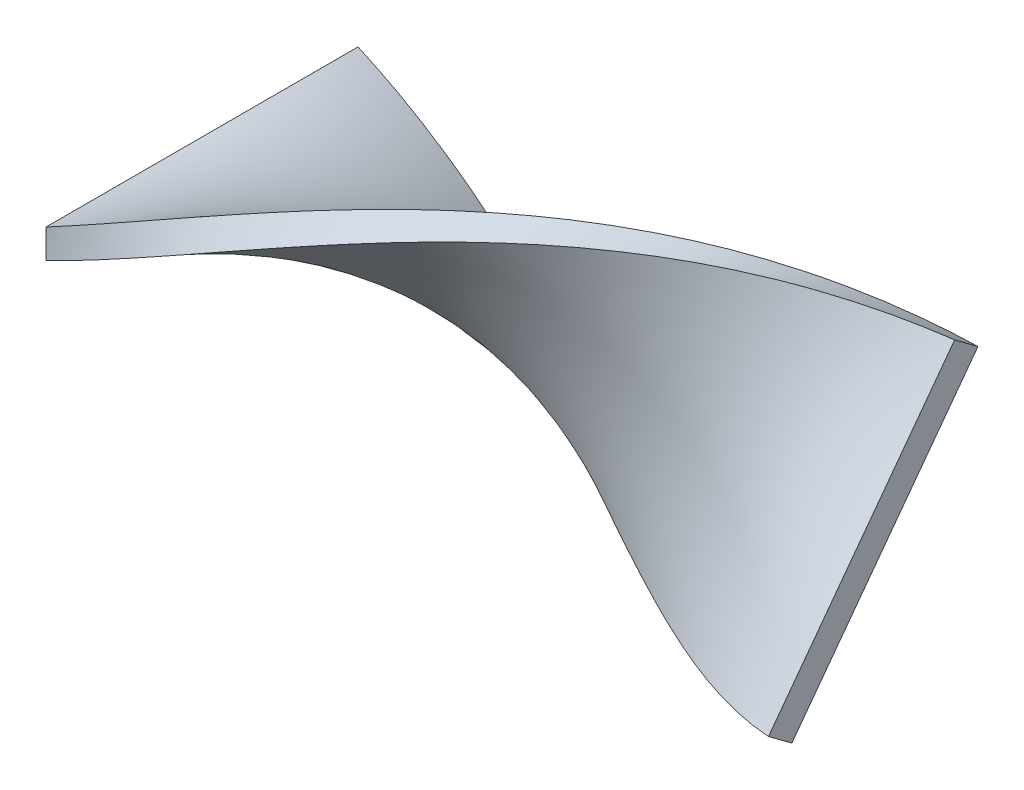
ISO-10303-21;
HEADER;
FILE_DESCRIPTION(('STEP AP214'),'2;1');
FILE_NAME('part.step','',(''),(''),'','','');
FILE_SCHEMA(('AUTOMOTIVE_DESIGN { 1 0 10303 214 1 1 1 1 }'));
ENDSEC;
DATA;
#1=APPLICATION_CONTEXT('core data for automotive mechanical design processes');
#2=APPLICATION_PROTOCOL_DEFINITION('international standard','automotive_design',2000,#1);
#3=PRODUCT_CONTEXT('',#1,'mechanical');
#4=PRODUCT('Part','Part','',(#3));
#5=PRODUCT_RELATED_PRODUCT_CATEGORY('part','',(#4));
#6=PRODUCT_DEFINITION_FORMATION('','',#4);
#7=PRODUCT_DEFINITION_CONTEXT('part definition',#1,'design');
#8=PRODUCT_DEFINITION('design','',#6,#7);
#9=PRODUCT_DEFINITION_SHAPE('','',#8);
#10=(LENGTH_UNIT() NAMED_UNIT(*) SI_UNIT(.MILLI.,.METRE.));
#11=(NAMED_UNIT(*) PLANE_ANGLE_UNIT() SI_UNIT($,.RADIAN.));
#12=(NAMED_UNIT(*) SI_UNIT($,.STERADIAN.) SOLID_ANGLE_UNIT());
#13=UNCERTAINTY_MEASURE_WITH_UNIT(LENGTH_MEASURE(1.E-05),#10,'distance_accuracy_value','');
#14=(GEOMETRIC_REPRESENTATION_CONTEXT(3) GLOBAL_UNCERTAINTY_ASSIGNED_CONTEXT((#13)) GLOBAL_UNIT_ASSIGNED_CONTEXT((#10,
#11,#12)) REPRESENTATION_CONTEXT('',''));
#15=CARTESIAN_POINT('',(0.,0.,0.));
#16=DIRECTION('',(0.,0.,1.));
#17=DIRECTION('',(1.,0.,0.));
#18=AXIS2_PLACEMENT_3D('',#15,#16,#17);
#19=CARTESIAN_POINT('',(-34.56399697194,0.,16.0727414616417));
#20=DIRECTION('',(1.,0.,0.));
#21=DIRECTION('',(0.,0.,-1.));
#22=AXIS2_PLACEMENT_3D('',#19,#20,#21);
#23=PLANE('',#22);
#24=DIRECTION('',(0.,0.,1.));
#25=VECTOR('',#24,1.);
#26=CARTESIAN_POINT('',(-34.5639969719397,0.,-9.19403442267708E-13));
#27=LINE('',#26,#25);
#28=CARTESIAN_POINT('',(-34.5639969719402,0.,-16.0727414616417));
#29=VERTEX_POINT('',#28);
#30=CARTESIAN_POINT('',(-34.5639969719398,0.,16.0727414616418));
#31=VERTEX_POINT('',#30);
#32=EDGE_CURVE('E13',#29,#31,#27,.T.);
#33=ORIENTED_EDGE('',*,*,#32,.T.);
#34=DIRECTION('',(0.,-1.,0.));
#35=VECTOR('',#34,1.);
#36=CARTESIAN_POINT('',(-34.5639969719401,1.5,16.0727414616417));
#37=LINE('',#36,#35);
#38=CARTESIAN_POINT('',(-34.5639969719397,2.99999999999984,16.0727414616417));
#39=VERTEX_POINT('',#38);
#40=EDGE_CURVE('E181',#39,#31,#37,.T.);
#41=ORIENTED_EDGE('',*,*,#40,.F.);
#42=DIRECTION('',(0.,0.,1.));
#43=VECTOR('',#42,1.);
#44=CARTESIAN_POINT('',(-34.5639969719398,2.99999999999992,-9.37618038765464E-13));
#45=LINE('',#44,#43);
#46=CARTESIAN_POINT('',(-34.5639969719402,3.00000000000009,-16.0727414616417));
#47=VERTEX_POINT('',#46);
#48=EDGE_CURVE('E217',#47,#39,#45,.T.);
#49=ORIENTED_EDGE('',*,*,#48,.F.);
#50=DIRECTION('',(0.,-1.,0.));
#51=VECTOR('',#50,1.);
#52=CARTESIAN_POINT('',(-34.5639969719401,1.5,-16.0727414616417));
#53=LINE('',#52,#51);
#54=EDGE_CURVE('E172',#47,#29,#53,.T.);
#55=ORIENTED_EDGE('',*,*,#54,.T.);
#56=EDGE_LOOP('',(#33,#41,#49,#55));
#57=FACE_BOUND('',#56,.T.);
#58=ADVANCED_FACE('F156',(#57),#23,.F.);
#59=CARTESIAN_POINT('',(34.56399697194,15.2753148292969,-8.37906919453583));
#60=CARTESIAN_POINT('',(34.56399697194,15.2693491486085,-8.38709481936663));
#61=CARTESIAN_POINT('',(34.56399697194,15.2633834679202,-8.39512044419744));
#62=CARTESIAN_POINT('',(34.56399697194,15.2574177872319,-8.40314606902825));
#63=CARTESIAN_POINT('',(34.5639969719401,14.6608497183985,-9.20570855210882));
#64=CARTESIAN_POINT('',(34.56399697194,14.0642816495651,-10.0082710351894));
#65=CARTESIAN_POINT('',(34.56399697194,13.4677135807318,-10.8108335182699));
#66=CARTESIAN_POINT('',(34.56399697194,13.4616882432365,-10.818939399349));
#67=CARTESIAN_POINT('',(34.56399697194,13.4556629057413,-10.8270452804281));
#68=CARTESIAN_POINT('',(34.56399697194,13.4496375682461,-10.8351511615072));
#69=CARTESIAN_POINT('',(29.0780211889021,16.7448598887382,-5.95901093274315));
#70=CARTESIAN_POINT('',(29.0780211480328,16.7403018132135,-5.96808282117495));
#71=CARTESIAN_POINT('',(29.0780211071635,16.7357437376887,-5.97715470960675));
#72=CARTESIAN_POINT('',(29.0780210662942,16.731185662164,-5.98622659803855));
#73=CARTESIAN_POINT('',(29.0780169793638,16.2753781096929,-6.89341544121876));
#74=CARTESIAN_POINT('',(29.0780170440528,15.819569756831,-7.80060634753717));
#75=CARTESIAN_POINT('',(29.0780212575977,15.3637596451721,-8.70779860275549));
#76=CARTESIAN_POINT('',(29.0780213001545,15.3591559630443,-8.7169612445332));
#77=CARTESIAN_POINT('',(29.0780213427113,15.3545522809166,-8.7261238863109));
#78=CARTESIAN_POINT('',(29.0780213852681,15.3499485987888,-8.73528652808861));
#79=CARTESIAN_POINT('',(19.2023691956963,18.2078331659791,-0.892584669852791));
#80=CARTESIAN_POINT('',(19.2023691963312,18.2063152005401,-0.902851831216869));
#81=CARTESIAN_POINT('',(19.2023691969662,18.2047972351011,-0.913118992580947));
#82=CARTESIAN_POINT('',(19.2023691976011,18.2032792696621,-0.923386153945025));
#83=CARTESIAN_POINT('',(19.2023692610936,18.0514827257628,-1.95010229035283));
#84=CARTESIAN_POINT('',(19.2023692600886,17.8996861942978,-2.97681839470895));
#85=CARTESIAN_POINT('',(19.2023691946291,17.7478896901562,-4.00353447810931));
#86=CARTESIAN_POINT('',(19.202369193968,17.7463565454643,-4.01390431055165));
#87=CARTESIAN_POINT('',(19.2023691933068,17.7448234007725,-4.02427414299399));
#88=CARTESIAN_POINT('',(19.2023691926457,17.7432902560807,-4.03464397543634));
#89=CARTESIAN_POINT('',(4.93771570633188,16.7798427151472,6.49494253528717));
#90=CARTESIAN_POINT('',(4.93771570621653,16.7829635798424,6.48512890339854));
#91=CARTESIAN_POINT('',(4.93771570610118,16.7860844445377,6.47531527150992));
#92=CARTESIAN_POINT('',(4.93771570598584,16.7892053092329,6.46550163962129));
#93=CARTESIAN_POINT('',(4.93771569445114,17.1012917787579,5.48413845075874));
#94=CARTESIAN_POINT('',(4.93771569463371,17.4133782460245,4.50277525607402));
#95=CARTESIAN_POINT('',(4.93771570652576,17.7254647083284,3.52141205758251));
#96=CARTESIAN_POINT('',(4.93771570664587,17.7286167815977,3.51150028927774));
#97=CARTESIAN_POINT('',(4.93771570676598,17.7317688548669,3.50158852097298));
#98=CARTESIAN_POINT('',(4.93771570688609,17.7349209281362,3.49167675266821));
#99=CARTESIAN_POINT('',(-7.13225567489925,13.1217089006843,11.7073304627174));
#100=CARTESIAN_POINT('',(-7.1322556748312,13.1282560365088,11.6994715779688));
#101=CARTESIAN_POINT('',(-7.13225567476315,13.1348031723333,11.6916126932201));
#102=CARTESIAN_POINT('',(-7.1322556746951,13.1413503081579,11.6837538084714));
#103=CARTESIAN_POINT('',(-7.13225566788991,13.7960638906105,10.8978653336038));
#104=CARTESIAN_POINT('',(-7.13225566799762,14.4507774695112,10.1119768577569));
#105=CARTESIAN_POINT('',(-7.13225567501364,15.1054910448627,9.32608838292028));
#106=CARTESIAN_POINT('',(-7.1322556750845,15.1121036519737,9.31815090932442));
#107=CARTESIAN_POINT('',(-7.13225567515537,15.1187162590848,9.31021343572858));
#108=CARTESIAN_POINT('',(-7.13225567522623,15.1253288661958,9.30227596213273));
#109=CARTESIAN_POINT('',(-20.2996387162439,7.40684570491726,15.5384666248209));
#110=CARTESIAN_POINT('',(-20.2996387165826,7.41608615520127,15.5339108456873));
#111=CARTESIAN_POINT('',(-20.2996387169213,7.42532660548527,15.5293550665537));
#112=CARTESIAN_POINT('',(-20.29963871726,7.43456705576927,15.5247992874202));
#113=CARTESIAN_POINT('',(-20.2996387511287,8.35861208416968,15.0692213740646));
#114=CARTESIAN_POINT('',(-20.2996387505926,9.28265713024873,14.6136434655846));
#115=CARTESIAN_POINT('',(-20.2996387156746,10.2067021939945,14.1580655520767));
#116=CARTESIAN_POINT('',(-20.2996387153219,10.2160350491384,14.1534642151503));
#117=CARTESIAN_POINT('',(-20.2996387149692,10.2253679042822,14.1488628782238));
#118=CARTESIAN_POINT('',(-20.2996387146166,10.234700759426,14.1442615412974));
#119=CARTESIAN_POINT('',(-29.0780211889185,2.78893162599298,16.3370692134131));
#120=CARTESIAN_POINT('',(-29.0780211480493,2.79893166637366,16.3353153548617));
#121=CARTESIAN_POINT('',(-29.0780211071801,2.80893170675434,16.3335614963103));
#122=CARTESIAN_POINT('',(-29.0780210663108,2.81893174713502,16.3318076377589));
#123=CARTESIAN_POINT('',(-29.0780169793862,3.81893578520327,16.1564217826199));
#124=CARTESIAN_POINT('',(-29.0780170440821,4.81893768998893,15.9810353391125));
#125=CARTESIAN_POINT('',(-29.0780212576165,5.81893746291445,15.8056495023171));
#126=CARTESIAN_POINT('',(-29.0780213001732,5.829037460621,15.8038781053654));
#127=CARTESIAN_POINT('',(-29.0780213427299,5.83913745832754,15.8021067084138));
#128=CARTESIAN_POINT('',(-29.0780213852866,5.84923745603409,15.8003353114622));
#129=CARTESIAN_POINT('',(-34.56399697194,-0.03,16.0727414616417));
#130=CARTESIAN_POINT('',(-34.56399697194,-0.02,16.0727414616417));
#131=CARTESIAN_POINT('',(-34.56399697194,-0.01,16.0727414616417));
#132=CARTESIAN_POINT('',(-34.56399697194,0.,16.0727414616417));
#133=CARTESIAN_POINT('',(-34.5639969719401,1.,16.0727414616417));
#134=CARTESIAN_POINT('',(-34.56399697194,2.,16.0727414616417));
#135=CARTESIAN_POINT('',(-34.56399697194,3.,16.0727414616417));
#136=CARTESIAN_POINT('',(-34.56399697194,3.0101,16.0727414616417));
#137=CARTESIAN_POINT('',(-34.56399697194,3.0202,16.0727414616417));
#138=CARTESIAN_POINT('',(-34.56399697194,3.0303,16.0727414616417));
#139=B_SPLINE_SURFACE_WITH_KNOTS('',3,3,((#59,#60,#61,#62,#63,#64,#65,#66,#67,#68),(#69,#70,#71,
#72,#73,#74,#75,#76,#77,#78),(#79,#80,#81,#82,#83,#84,#85,#86,#87,#88),(#89,#90,#91,#92,#93,#94,
#95,#96,#97,#98),(#99,#100,#101,#102,#103,#104,#105,#106,#107,#108),(#109,#110,#111,#112,#113,
#114,#115,#116,#117,#118),(#119,#120,#121,#122,#123,#124,#125,#126,#127,#128),(#129,#130,#131,
#132,#133,#134,#135,#136,#137,#138)),.UNSPECIFIED.,.F.,.F.,.F.,(4,1,1,1,1,4),(4,3,3,4),(0.,
0.238098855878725,0.428572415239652,0.619045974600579,0.761901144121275,1.),(-0.01,0.,1.,
1.0101),.UNSPECIFIED.);
#140=CARTESIAN_POINT('',(-34.56399697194,0.,16.0727414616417));
#141=CARTESIAN_POINT('',(-34.1025789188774,0.237097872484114,16.0945316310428));
#142=CARTESIAN_POINT('',(-33.641155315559,0.474672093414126,16.1109200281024));
#143=CARTESIAN_POINT('',(-32.718388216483,0.95025658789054,16.1329850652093));
#144=CARTESIAN_POINT('',(-32.2570447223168,1.18826676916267,16.1386637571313));
#145=CARTESIAN_POINT('',(-31.3337305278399,1.66461850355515,16.1394099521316));
#146=CARTESIAN_POINT('',(-30.8717598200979,1.90296007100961,16.1344631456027));
#147=CARTESIAN_POINT('',(-29.947742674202,2.37922611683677,16.1140250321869));
#148=CARTESIAN_POINT('',(-29.4856962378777,2.6171505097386,16.0985317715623));
#149=CARTESIAN_POINT('',(-27.7730295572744,3.49736253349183,16.0217346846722));
#150=CARTESIAN_POINT('',(-26.5222717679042,4.13681667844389,15.9273738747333));
#151=CARTESIAN_POINT('',(-24.0200799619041,5.40040031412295,15.6638865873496));
#152=CARTESIAN_POINT('',(-22.768645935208,6.02452157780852,15.4947208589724));
#153=CARTESIAN_POINT('',(-20.8916028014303,6.94237692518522,15.1861814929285));
#154=CARTESIAN_POINT('',(-20.2658802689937,7.24530220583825,15.0741899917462));
#155=CARTESIAN_POINT('',(-19.0144383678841,7.84389880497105,14.8321387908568));
#156=CARTESIAN_POINT('',(-18.38871899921,8.13957012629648,14.7020790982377));
#157=CARTESIAN_POINT('',(-17.1367135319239,8.72272294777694,14.4241046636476));
#158=CARTESIAN_POINT('',(-16.5104274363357,9.0101967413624,14.2761737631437));
#159=CARTESIAN_POINT('',(-15.257845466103,9.57569644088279,13.9632673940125));
#160=CARTESIAN_POINT('',(-14.6315495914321,9.85372231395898,13.7982918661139));
#161=CARTESIAN_POINT('',(-13.3790095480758,10.3993229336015,13.4519737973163));
#162=CARTESIAN_POINT('',(-12.7527653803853,10.6668987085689,13.2706328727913));
#163=CARTESIAN_POINT('',(-11.5002749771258,11.190681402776,12.8922152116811));
#164=CARTESIAN_POINT('',(-10.874028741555,11.4468883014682,12.6951384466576));
#165=CARTESIAN_POINT('',(-9.62155640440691,11.9469635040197,12.2859065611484));
#166=CARTESIAN_POINT('',(-8.99533030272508,12.1908321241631,12.0737518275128));
#167=CARTESIAN_POINT('',(-7.74287207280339,12.6652136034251,11.635048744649));
#168=CARTESIAN_POINT('',(-7.1166399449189,12.8957267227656,11.4085006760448));
#169=CARTESIAN_POINT('',(-6.02097277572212,13.2867281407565,11.000394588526));
#170=CARTESIAN_POINT('',(-5.55153863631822,13.4502980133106,10.8217748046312));
#171=CARTESIAN_POINT('',(-4.61267335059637,13.7692560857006,10.4574037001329));
#172=CARTESIAN_POINT('',(-4.14324220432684,13.924644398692,10.2716524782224));
#173=CARTESIAN_POINT('',(-2.73489542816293,14.3781456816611,9.70426692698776));
#174=CARTESIAN_POINT('',(-1.79593033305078,14.6635936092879,9.31250216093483));
#175=CARTESIAN_POINT('',(0.0819132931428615,15.1985218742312,8.50496313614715));
#176=CARTESIAN_POINT('',(1.02079182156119,15.4480013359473,8.08918829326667));
#177=CARTESIAN_POINT('',(2.89847856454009,15.9087010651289,7.23671087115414));
#178=CARTESIAN_POINT('',(3.83728677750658,16.1199206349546,6.80000791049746));
#179=CARTESIAN_POINT('',(5.71504661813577,16.5016354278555,5.909082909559));
#180=CARTESIAN_POINT('',(6.65399824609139,16.6721245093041,5.45485823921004));
#181=CARTESIAN_POINT('',(8.53197762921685,16.9714923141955,4.53305568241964));
#182=CARTESIAN_POINT('',(9.471005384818,17.1003707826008,4.06547771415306));
#183=CARTESIAN_POINT('',(11.349088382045,17.3158348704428,3.12090936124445));
#184=CARTESIAN_POINT('',(12.2881436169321,17.4024235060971,2.64391965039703));
#185=CARTESIAN_POINT('',(14.1661382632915,17.5326091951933,1.68423191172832));
#186=CARTESIAN_POINT('',(15.1050776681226,17.5762133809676,1.20153484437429));
#187=CARTESIAN_POINT('',(16.8153159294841,17.6157598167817,0.320387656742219));
#188=CARTESIAN_POINT('',(17.5866308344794,17.6188186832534,-0.0777254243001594));
#189=CARTESIAN_POINT('',(19.1291978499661,17.5950434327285,-0.873016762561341));
#190=CARTESIAN_POINT('',(19.9004499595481,17.5682121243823,-1.27019510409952));
#191=CARTESIAN_POINT('',(21.4429281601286,17.4853074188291,-2.06145969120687));
#192=CARTESIAN_POINT('',(22.2141542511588,17.4292349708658,-2.45554603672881));
#193=CARTESIAN_POINT('',(23.7565793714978,17.2883925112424,-3.23859806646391));
#194=CARTESIAN_POINT('',(24.5277784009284,17.2036226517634,-3.62756377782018));
#195=CARTESIAN_POINT('',(26.0710027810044,17.0058195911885,-4.39875439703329));
#196=CARTESIAN_POINT('',(26.8430281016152,16.8927552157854,-4.78097136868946));
#197=CARTESIAN_POINT('',(28.3870851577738,16.6389464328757,-5.53614232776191));
#198=CARTESIAN_POINT('',(29.1591168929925,16.4982013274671,-5.90909608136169));
#199=CARTESIAN_POINT('',(30.7032352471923,16.1895708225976,-6.64363344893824));
#200=CARTESIAN_POINT('',(31.4753218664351,16.0216836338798,-7.0052163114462));
#201=CARTESIAN_POINT('',(33.0196054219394,15.6593346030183,-7.71487141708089));
#202=CARTESIAN_POINT('',(33.7918023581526,15.4648689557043,-8.06294171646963));
#203=CARTESIAN_POINT('',(34.56399697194,15.2574177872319,-8.40314606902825));
#204=B_SPLINE_CURVE_WITH_KNOTS('',3,(#140,#141,#142,#143,#144,#145,#146,#147,#148,#149,#150,
#151,#152,#153,#154,#155,#156,#157,#158,#159,#160,#161,#162,#163,#164,#165,#166,#167,#168,#169,
#170,#171,#172,#173,#174,#175,#176,#177,#178,#179,#180,#181,#182,#183,#184,#185,#186,#187,#188,
#189,#190,#191,#192,#193,#194,#195,#196,#197,#198,#199,#200,#201,#202,#203),.UNSPECIFIED.,.F.,
.F.,(4,2,2,2,2,2,2,2,2,2,2,2,2,2,2,2,2,2,2,2,2,2,2,2,2,2,2,2,2,2,2,4),(0.,1.55764615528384,
3.11499385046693,4.67444017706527,6.23417547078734,10.45563605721,14.679314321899,
16.7915550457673,18.9037949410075,21.0179591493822,23.1321307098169,25.2460936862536,
27.3600604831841,29.4739730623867,31.5878444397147,33.1724288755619,34.7569913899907,
37.9261294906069,41.0953447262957,44.2646177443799,47.4343683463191,50.6041383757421,
53.7736822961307,56.9427002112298,59.5462174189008,62.1494900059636,64.7526780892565,
67.3558523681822,69.9619074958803,72.5680283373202,75.1743210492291,77.7809872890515),.UNSPECIFIED.);
#205=CARTESIAN_POINT('',(34.5639969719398,15.2574177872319,-8.40314606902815));
#206=VERTEX_POINT('',#205);
#207=EDGE_CURVE('E226',#31,#206,#204,.T.);
#208=DIRECTION('',(0.,0.596568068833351,0.802562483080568));
#209=VECTOR('',#208,1.);
#210=CARTESIAN_POINT('',(34.56399697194,14.3625656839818,-9.60698979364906));
#211=LINE('',#210,#209);
#212=CARTESIAN_POINT('',(34.5639969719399,13.4677135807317,-10.81083351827));
#213=VERTEX_POINT('',#212);
#214=EDGE_CURVE('E263',#213,#206,#211,.T.);
#215=CARTESIAN_POINT('',(-34.56399697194,3.,16.0727414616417));
#216=CARTESIAN_POINT('',(-33.6320295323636,3.47889871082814,16.0273726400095));
#217=CARTESIAN_POINT('',(-32.7000967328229,3.95562231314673,15.9599850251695));
#218=CARTESIAN_POINT('',(-30.8349676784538,4.90174310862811,15.7825149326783));
#219=CARTESIAN_POINT('',(-29.9017714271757,5.37112946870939,15.6723745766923));
#220=CARTESIAN_POINT('',(-27.7050579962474,6.46233131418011,15.3646019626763));
#221=CARTESIAN_POINT('',(-26.4415140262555,7.07930556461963,15.1498010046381));
#222=CARTESIAN_POINT('',(-23.9136227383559,8.28346752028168,14.6481612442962));
#223=CARTESIAN_POINT('',(-22.6492753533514,8.87063905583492,14.361283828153));
#224=CARTESIAN_POINT('',(-20.7528162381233,9.72233214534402,13.8796624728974));
#225=CARTESIAN_POINT('',(-20.1206122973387,10.0014114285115,13.7105522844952));
#226=CARTESIAN_POINT('',(-18.8562123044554,10.5488036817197,13.3556197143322));
#227=CARTESIAN_POINT('',(-18.2240162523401,10.8171166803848,13.1697973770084));
#228=CARTESIAN_POINT('',(-16.9590507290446,11.3421144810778,12.7818278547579));
#229=CARTESIAN_POINT('',(-16.3262812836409,11.5987879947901,12.5796653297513));
#230=CARTESIAN_POINT('',(-15.0607415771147,12.0993602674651,12.1600924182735));
#231=CARTESIAN_POINT('',(-14.4279713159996,12.3432589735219,11.9426819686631));
#232=CARTESIAN_POINT('',(-13.162486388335,12.8173772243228,11.493497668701));
#233=CARTESIAN_POINT('',(-12.5297717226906,13.0475981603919,11.2617252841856));
#234=CARTESIAN_POINT('',(-11.2643307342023,13.4935422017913,10.7846547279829));
#235=CARTESIAN_POINT('',(-10.6316044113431,13.7092652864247,10.5393565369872));
#236=CARTESIAN_POINT('',(-9.36617131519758,14.1253653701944,10.0360727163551));
#237=CARTESIAN_POINT('',(-8.73346454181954,14.3257427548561,9.77808740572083));
#238=CARTESIAN_POINT('',(-7.468061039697,14.7102914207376,9.25031125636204));
#239=CARTESIAN_POINT('',(-6.83536431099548,14.8944630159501,8.98052064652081));
#240=CARTESIAN_POINT('',(-5.72838659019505,15.2020515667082,8.49918593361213));
#241=CARTESIAN_POINT('',(-5.25410651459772,15.3291342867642,8.28997186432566));
#242=CARTESIAN_POINT('',(-4.30554405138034,15.573683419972,7.86603613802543));
#243=CARTESIAN_POINT('',(-3.83126166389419,15.6911499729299,7.65131456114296));
#244=CARTESIAN_POINT('',(-2.40833579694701,16.0288281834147,6.99956246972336));
#245=CARTESIAN_POINT('',(-1.45961881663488,16.2343169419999,6.55494686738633));
#246=CARTESIAN_POINT('',(0.437787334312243,16.6044828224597,5.64899132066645));
#247=CARTESIAN_POINT('',(1.38647650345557,16.7691588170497,5.18765091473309));
#248=CARTESIAN_POINT('',(3.28376401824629,17.0560221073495,4.25165958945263));
#249=CARTESIAN_POINT('',(4.23236236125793,17.1782084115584,3.77700835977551));
#250=CARTESIAN_POINT('',(6.12955541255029,17.3783478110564,2.81824562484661));
#251=CARTESIAN_POINT('',(7.07815011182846,17.4562966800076,2.33413322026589));
#252=CARTESIAN_POINT('',(8.97537034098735,17.5679096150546,1.36089351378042));
#253=CARTESIAN_POINT('',(9.92399587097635,17.6015735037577,0.871766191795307));
#254=CARTESIAN_POINT('',(11.8212497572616,17.6246107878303,-0.107299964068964));
#255=CARTESIAN_POINT('',(12.769878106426,17.6139879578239,-0.597238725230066));
#256=CARTESIAN_POINT('',(14.6670597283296,17.5484906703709,-1.57396332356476));
#257=CARTESIAN_POINT('',(15.6156129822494,17.4936244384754,-2.06074972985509));
#258=CARTESIAN_POINT('',(16.9389627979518,17.3862022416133,-2.73502085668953));
#259=CARTESIAN_POINT('',(17.3138319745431,17.3523148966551,-2.92547979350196));
#260=CARTESIAN_POINT('',(18.0635642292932,17.2776124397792,-3.30504409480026));
#261=CARTESIAN_POINT('',(18.4384273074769,17.2367973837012,-3.49414947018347));
#262=CARTESIAN_POINT('',(19.5629329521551,17.1040792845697,-4.05901553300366));
#263=CARTESIAN_POINT('',(20.3125921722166,17.0018951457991,-4.43237737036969));
#264=CARTESIAN_POINT('',(21.8118867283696,16.7710437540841,-5.17074259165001));
#265=CARTESIAN_POINT('',(22.5615220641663,16.6423775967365,-5.5357463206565));
#266=CARTESIAN_POINT('',(24.0607833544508,16.3594221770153,-6.25568575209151));
#267=CARTESIAN_POINT('',(24.810409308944,16.2051332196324,-6.61062157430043));
#268=CARTESIAN_POINT('',(26.3103113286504,15.8716312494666,-7.30899663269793));
#269=CARTESIAN_POINT('',(27.0605873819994,15.6923962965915,-7.6524254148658));
#270=CARTESIAN_POINT('',(28.5611510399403,15.3099430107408,-8.32568998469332));
#271=CARTESIAN_POINT('',(29.3114386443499,15.1067240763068,-8.65552543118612));
#272=CARTESIAN_POINT('',(30.8120614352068,14.6771380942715,-9.29980883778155));
#273=CARTESIAN_POINT('',(31.5623966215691,14.4507695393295,-9.61425579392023));
#274=CARTESIAN_POINT('',(33.0631580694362,13.9757388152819,-10.2259335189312));
#275=CARTESIAN_POINT('',(33.8135843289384,13.7270735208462,-10.5231618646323));
#276=CARTESIAN_POINT('',(34.56399697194,13.4677135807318,-10.8108335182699));
#277=B_SPLINE_CURVE_WITH_KNOTS('',3,(#215,#216,#217,#218,#219,#220,#221,#222,#223,#224,#225,
#226,#227,#228,#229,#230,#231,#232,#233,#234,#235,#236,#237,#238,#239,#240,#241,#242,#243,#244,
#245,#246,#247,#248,#249,#250,#251,#252,#253,#254,#255,#256,#257,#258,#259,#260,#261,#262,#263,
#264,#265,#266,#267,#268,#269,#270,#271,#272,#273,#274,#275,#276),.UNSPECIFIED.,.F.,.F.,(4,2,2,
2,2,2,2,2,2,2,2,2,2,2,2,2,2,2,2,2,2,2,2,2,2,2,2,2,2,2,4),(0.,3.14602391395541,6.29632182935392,
10.5614665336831,14.828901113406,16.9630318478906,19.0971569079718,21.2333092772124,
23.369470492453,25.505414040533,27.6413606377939,29.777253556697,31.9131050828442,
33.5141659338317,35.1152035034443,38.3172962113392,41.5194773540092,44.7217332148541,
47.9242949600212,51.1268695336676,54.3291711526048,57.5308775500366,58.7963552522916,
60.0618227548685,62.5924193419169,65.1229112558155,67.6533730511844,70.1860746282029,
72.7188397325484,75.2517698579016,77.7850555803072),.UNSPECIFIED.);
#278=EDGE_CURVE('E221',#39,#213,#277,.T.);
#279=ORIENTED_EDGE('',*,*,#207,.T.);
#280=ORIENTED_EDGE('',*,*,#214,.F.);
#281=ORIENTED_EDGE('',*,*,#278,.F.);
#282=ORIENTED_EDGE('',*,*,#40,.T.);
#283=EDGE_LOOP('',(#279,#280,#281,#282));
#284=FACE_BOUND('',#283,.T.);
#285=ADVANCED_FACE('F238',(#284),#139,.F.);
#286=CARTESIAN_POINT('',(34.56399697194,-10.541340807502,10.773822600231));
#287=DIRECTION('',(-1.,0.,0.));
#288=DIRECTION('',(0.,0.802562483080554,-0.59656806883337));
#289=AXIS2_PLACEMENT_3D('',#286,#287,#288);
#290=PLANE('',#289);
#291=DIRECTION('',(0.,-0.802562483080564,0.596568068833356));
#292=VECTOR('',#291,1.);
#293=CARTESIAN_POINT('',(34.5639969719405,2.35803848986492,1.18533826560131));
#294=LINE('',#293,#292);
#295=CARTESIAN_POINT('',(34.5639969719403,-10.5413408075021,10.7738226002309));
#296=VERTEX_POINT('',#295);
#297=EDGE_CURVE('E215',#206,#296,#294,.T.);
#298=ORIENTED_EDGE('',*,*,#297,.T.);
#299=DIRECTION('',(0.,0.596568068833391,0.802562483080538));
#300=VECTOR('',#299,1.);
#301=CARTESIAN_POINT('',(34.56399697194,-11.4361929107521,9.56997887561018));
#302=LINE('',#301,#300);
#303=CARTESIAN_POINT('',(34.5639969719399,-12.3310450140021,8.36613515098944));
#304=VERTEX_POINT('',#303);
#305=EDGE_CURVE('E203',#304,#296,#302,.T.);
#306=ORIENTED_EDGE('',*,*,#305,.F.);
#307=DIRECTION('',(0.,-0.802562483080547,0.596568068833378));
#308=VECTOR('',#307,1.);
#309=CARTESIAN_POINT('',(34.5639969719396,0.568334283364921,-1.22234918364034));
#310=LINE('',#309,#308);
#311=EDGE_CURVE('E210',#213,#304,#310,.T.);
#312=ORIENTED_EDGE('',*,*,#311,.F.);
#313=ORIENTED_EDGE('',*,*,#214,.T.);
#314=EDGE_LOOP('',(#298,#306,#312,#313));
#315=FACE_BOUND('',#314,.T.);
#316=ADVANCED_FACE('F158',(#315),#290,.F.);
#317=CARTESIAN_POINT('',(-34.56399697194,-0.03,-16.0727414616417));
#318=CARTESIAN_POINT('',(-34.56399697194,-0.02,-16.0727414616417));
#319=CARTESIAN_POINT('',(-34.56399697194,-0.00999999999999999,-16.0727414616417));
#320=CARTESIAN_POINT('',(-34.56399697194,0.,-16.0727414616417));
#321=CARTESIAN_POINT('',(-34.56399697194,0.999999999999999,-16.0727414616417));
#322=CARTESIAN_POINT('',(-34.56399697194,2.,-16.0727414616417));
#323=CARTESIAN_POINT('',(-34.56399697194,3.,-16.0727414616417));
#324=CARTESIAN_POINT('',(-34.56399697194,3.0101,-16.0727414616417));
#325=CARTESIAN_POINT('',(-34.56399697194,3.0202,-16.0727414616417));
#326=CARTESIAN_POINT('',(-34.56399697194,3.0303,-16.0727414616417));
#327=CARTESIAN_POINT('',(-29.0780211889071,-2.84893162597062,-15.8084137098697));
#328=CARTESIAN_POINT('',(-29.0780211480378,-2.83893166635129,-15.8101675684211));
#329=CARTESIAN_POINT('',(-29.0780211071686,-2.82893170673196,-15.8119214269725));
#330=CARTESIAN_POINT('',(-29.0780210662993,-2.81893174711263,-15.8136752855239));
#331=CARTESIAN_POINT('',(-29.078016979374,-1.81893578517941,-15.9890611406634));
#332=CARTESIAN_POINT('',(-29.0780170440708,-0.8189376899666,-16.164447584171));
#333=CARTESIAN_POINT('',(-29.0780212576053,0.181062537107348,-16.3398334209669));
#334=CARTESIAN_POINT('',(-29.078021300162,0.191162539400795,-16.3416048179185));
#335=CARTESIAN_POINT('',(-29.0780213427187,0.201262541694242,-16.3433762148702));
#336=CARTESIAN_POINT('',(-29.0780213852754,0.211362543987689,-16.3451476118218));
#337=CARTESIAN_POINT('',(-19.2023691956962,-7.78781841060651,-13.9600730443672));
#338=CARTESIAN_POINT('',(-19.2023691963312,-7.77867280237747,-13.9649798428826));
#339=CARTESIAN_POINT('',(-19.2023691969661,-7.76952719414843,-13.969886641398));
#340=CARTESIAN_POINT('',(-19.202369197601,-7.76038158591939,-13.9747934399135));
#341=CARTESIAN_POINT('',(-19.2023692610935,-6.84582076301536,-14.4654732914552));
#342=CARTESIAN_POINT('',(-19.2023692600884,-5.93125997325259,-14.9561531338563));
#343=CARTESIAN_POINT('',(-19.202369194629,-5.01669921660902,-15.4468329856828));
#344=CARTESIAN_POINT('',(-19.2023691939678,-5.00746215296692,-15.4517888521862));
#345=CARTESIAN_POINT('',(-19.2023691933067,-4.99822508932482,-15.4567447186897));
#346=CARTESIAN_POINT('',(-19.2023691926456,-4.98898802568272,-15.4617005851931));
#347=CARTESIAN_POINT('',(-4.93771570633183,-12.8648770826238,-8.40685864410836));
#348=CARTESIAN_POINT('',(-4.93771570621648,-12.8588628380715,-8.41521783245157));
#349=CARTESIAN_POINT('',(-4.93771570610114,-12.8528485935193,-8.42357702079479));
#350=CARTESIAN_POINT('',(-4.93771570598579,-12.8468343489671,-8.43193620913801));
#351=CARTESIAN_POINT('',(-4.93771569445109,-12.2454098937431,-9.26785504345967));
#352=CARTESIAN_POINT('',(-4.93771569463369,-11.6439854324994,-10.1037738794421));
#353=CARTESIAN_POINT('',(-4.93771570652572,-11.0425609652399,-10.939692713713));
#354=CARTESIAN_POINT('',(-4.93771570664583,-11.0364865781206,-10.9481354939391));
#355=CARTESIAN_POINT('',(-4.93771570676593,-11.0304121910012,-10.9565782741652));
#356=CARTESIAN_POINT('',(-4.93771570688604,-11.0243378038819,-10.9650210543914));
#357=CARTESIAN_POINT('',(7.13225567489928,-14.8658182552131,-2.3614334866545));
#358=CARTESIAN_POINT('',(7.13225567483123,-14.8634168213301,-2.37137633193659));
#359=CARTESIAN_POINT('',(7.13225567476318,-14.8610153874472,-2.38131917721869));
#360=CARTESIAN_POINT('',(7.13225567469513,-14.8586139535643,-2.39126202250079));
#361=CARTESIAN_POINT('',(7.13225566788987,-14.6184705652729,-3.38554655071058));
#362=CARTESIAN_POINT('',(7.13225566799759,-14.3783271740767,-4.37983107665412));
#363=CARTESIAN_POINT('',(7.13225567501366,-14.1381837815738,-5.37411559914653));
#364=CARTESIAN_POINT('',(7.13225567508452,-14.1357583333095,-5.3841578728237));
#365=CARTESIAN_POINT('',(7.13225567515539,-14.1333328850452,-5.39420014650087));
#366=CARTESIAN_POINT('',(7.13225567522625,-14.1309074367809,-5.40424242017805));
#367=CARTESIAN_POINT('',(20.2996387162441,-14.531239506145,4.51063481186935));
#368=CARTESIAN_POINT('',(20.2996387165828,-14.5330957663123,4.5005009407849));
#369=CARTESIAN_POINT('',(20.2996387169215,-14.5349520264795,4.49036706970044));
#370=CARTESIAN_POINT('',(20.2996387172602,-14.5368082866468,4.48023319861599));
#371=CARTESIAN_POINT('',(20.2996387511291,-14.7224343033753,3.46684609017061));
#372=CARTESIAN_POINT('',(20.299638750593,-14.9080603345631,2.45345897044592));
#373=CARTESIAN_POINT('',(20.2996387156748,-15.0936863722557,1.44007183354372));
#374=CARTESIAN_POINT('',(20.2996387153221,-15.0955611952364,1.42983662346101));
#375=CARTESIAN_POINT('',(20.2996387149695,-15.0974360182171,1.41960141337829));
#376=CARTESIAN_POINT('',(20.2996387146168,-15.0993108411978,1.40936620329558));
#377=CARTESIAN_POINT('',(29.0780211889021,-12.4172678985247,8.69322020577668));
#378=CARTESIAN_POINT('',(29.0780211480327,-12.4218260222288,8.68414825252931));
#379=CARTESIAN_POINT('',(29.0780211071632,-12.426384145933,8.67507629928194));
#380=CARTESIAN_POINT('',(29.0780210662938,-12.4309422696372,8.66600434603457));
#381=CARTESIAN_POINT('',(29.0780169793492,-12.8867546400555,7.75880902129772));
#382=CARTESIAN_POINT('',(29.0780170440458,-13.3425652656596,6.8516150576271));
#383=CARTESIAN_POINT('',(29.0780212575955,-13.7983751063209,5.94442316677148));
#384=CARTESIAN_POINT('',(29.0780213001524,-13.8029787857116,5.93526052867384));
#385=CARTESIAN_POINT('',(29.0780213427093,-13.8075824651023,5.9260978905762));
#386=CARTESIAN_POINT('',(29.0780213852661,-13.8121861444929,5.91693525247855));
#387=CARTESIAN_POINT('',(34.56399697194,-10.523443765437,10.7978994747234));
#388=CARTESIAN_POINT('',(34.56399697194,-10.5294094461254,10.7898738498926));
#389=CARTESIAN_POINT('',(34.56399697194,-10.5353751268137,10.7818482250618));
#390=CARTESIAN_POINT('',(34.56399697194,-10.541340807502,10.773822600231));
#391=CARTESIAN_POINT('',(34.56399697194,-11.1379088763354,9.97126011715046));
#392=CARTESIAN_POINT('',(34.56399697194,-11.7344769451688,9.16869763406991));
#393=CARTESIAN_POINT('',(34.56399697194,-12.3310450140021,8.36613515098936));
#394=CARTESIAN_POINT('',(34.56399697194,-12.3370703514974,8.35802926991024));
#395=CARTESIAN_POINT('',(34.56399697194,-12.3430956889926,8.34992338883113));
#396=CARTESIAN_POINT('',(34.56399697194,-12.3491210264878,8.34181750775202));
#397=B_SPLINE_SURFACE_WITH_KNOTS('',3,3,((#317,#318,#319,#320,#321,#322,#323,#324,#325,#326),
(#327,#328,#329,#330,#331,#332,#333,#334,#335,#336),(#337,#338,#339,#340,#341,#342,#343,#344,
#345,#346),(#347,#348,#349,#350,#351,#352,#353,#354,#355,#356),(#357,#358,#359,#360,#361,#362,
#363,#364,#365,#366),(#367,#368,#369,#370,#371,#372,#373,#374,#375,#376),(#377,#378,#379,#380,
#381,#382,#383,#384,#385,#386),(#387,#388,#389,#390,#391,#392,#393,#394,#395,#396)),
.UNSPECIFIED.,.F.,.F.,.F.,(4,1,1,1,1,4),(4,3,3,4),(0.,0.238098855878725,0.428572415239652,
0.61904597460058,0.761901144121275,1.),(-0.01,0.,1.,1.0101),.UNSPECIFIED.);
#398=CARTESIAN_POINT('',(34.56399697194,-10.541340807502,10.773822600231));
#399=CARTESIAN_POINT('',(34.1025720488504,-10.7002754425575,10.5965336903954));
#400=CARTESIAN_POINT('',(33.641149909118,-10.8551562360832,10.4156440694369));
#401=CARTESIAN_POINT('',(32.7183856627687,-11.1565805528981,10.0471255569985));
#402=CARTESIAN_POINT('',(32.2570435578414,-11.3031256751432,9.85949796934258));
#403=CARTESIAN_POINT('',(30.8717035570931,-11.7303972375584,9.28656770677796));
#404=CARTESIAN_POINT('',(29.9476708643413,-11.9983182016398,8.89171128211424));
#405=CARTESIAN_POINT('',(27.772941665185,-12.5868280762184,7.93653944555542));
#406=CARTESIAN_POINT('',(26.5222267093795,-12.8925601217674,7.36707225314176));
#407=CARTESIAN_POINT('',(24.0200548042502,-13.4348976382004,6.19580854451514));
#408=CARTESIAN_POINT('',(22.7685978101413,-13.6714667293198,5.59399521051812));
#409=CARTESIAN_POINT('',(20.8915324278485,-13.9714089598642,4.673315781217));
#410=CARTESIAN_POINT('',(20.2658049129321,-14.0622437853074,4.36339929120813));
#411=CARTESIAN_POINT('',(19.0143416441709,-14.225084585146,3.73863154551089));
#412=CARTESIAN_POINT('',(18.3886058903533,-14.2970906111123,3.42378030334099));
#413=CARTESIAN_POINT('',(17.1365545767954,-14.4218912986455,2.79001469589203));
#414=CARTESIAN_POINT('',(16.5102390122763,-14.4746682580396,2.47109686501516));
#415=CARTESIAN_POINT('',(15.2576015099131,-14.5609130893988,1.8306676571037));
#416=CARTESIAN_POINT('',(14.6312795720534,-14.5943808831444,1.50915626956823));
#417=CARTESIAN_POINT('',(13.3787210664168,-14.6419451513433,0.864691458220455));
#418=CARTESIAN_POINT('',(12.7524844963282,-14.6560435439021,0.541738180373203));
#419=CARTESIAN_POINT('',(11.5000458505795,-14.6648141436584,-0.104502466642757));
#420=CARTESIAN_POINT('',(10.8738437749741,-14.6594863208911,-0.42778983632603));
#421=CARTESIAN_POINT('',(9.62147982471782,-14.6293472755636,-1.07349782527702));
#422=CARTESIAN_POINT('',(8.99531794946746,-14.6045365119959,-1.39591846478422));
#423=CARTESIAN_POINT('',(7.74299912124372,-14.535372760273,-2.03864530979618));
#424=CARTESIAN_POINT('',(7.11684216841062,-14.4910201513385,-2.35895155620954));
#425=CARTESIAN_POINT('',(6.02130814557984,-14.3966462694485,-2.91647233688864));
#426=CARTESIAN_POINT('',(5.55193289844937,-14.3508252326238,-3.15441009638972));
#427=CARTESIAN_POINT('',(4.61317556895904,-14.2485761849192,-3.6279523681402));
#428=CARTESIAN_POINT('',(4.14379348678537,-14.1921483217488,-3.86355691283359));
#429=CARTESIAN_POINT('',(2.73556672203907,-14.007185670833,-4.56619869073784));
#430=CARTESIAN_POINT('',(1.79664633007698,-13.8629722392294,-5.02906161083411));
#431=CARTESIAN_POINT('',(-0.0812603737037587,-13.5339636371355,-5.93998010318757));
#432=CARTESIAN_POINT('',(-1.02024668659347,-13.349167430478,-6.38803529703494));
#433=CARTESIAN_POINT('',(-2.89819814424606,-12.94005582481,-7.26586321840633));
#434=CARTESIAN_POINT('',(-3.83716328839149,-12.7157397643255,-7.69563563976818));
#435=CARTESIAN_POINT('',(-5.71521788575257,-12.2287714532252,-8.53301417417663));
#436=CARTESIAN_POINT('',(-6.65430733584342,-11.9661133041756,-8.94061686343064));
#437=CARTESIAN_POINT('',(-8.53249586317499,-11.4052018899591,-9.73051394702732));
#438=CARTESIAN_POINT('',(-9.47159494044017,-11.1069484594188,-10.1128082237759));
#439=CARTESIAN_POINT('',(-11.3497107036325,-10.4775052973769,-10.8492209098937));
#440=CARTESIAN_POINT('',(-12.2887273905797,-10.1463179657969,-11.2033413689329));
#441=CARTESIAN_POINT('',(-14.1665741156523,-9.45358064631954,-11.8805479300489));
#442=CARTESIAN_POINT('',(-15.1054041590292,-9.09203567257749,-12.2036391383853));
#443=CARTESIAN_POINT('',(-16.8154976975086,-8.40822921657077,-12.7612044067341));
#444=CARTESIAN_POINT('',(-17.5867673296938,-8.0904705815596,-13.0012036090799));
#445=CARTESIAN_POINT('',(-19.1292803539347,-7.43792899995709,-13.4566154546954));
#446=CARTESIAN_POINT('',(-19.9005237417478,-7.10314764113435,-13.6720303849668));
#447=CARTESIAN_POINT('',(-21.4429964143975,-6.41864203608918,-14.0775383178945));
#448=CARTESIAN_POINT('',(-22.2142256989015,-6.06891826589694,-14.2676321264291));
#449=CARTESIAN_POINT('',(-23.7566548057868,-5.35645582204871,-14.6217359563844));
#450=CARTESIAN_POINT('',(-24.5278546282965,-4.99371721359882,-14.7857461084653));
#451=CARTESIAN_POINT('',(-26.0710747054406,-4.25679106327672,-15.0870611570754));
#452=CARTESIAN_POINT('',(-26.8430949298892,-3.88259137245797,-15.224336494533));
#453=CARTESIAN_POINT('',(-28.3871404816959,-3.12511094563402,-15.4711471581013));
#454=CARTESIAN_POINT('',(-29.1591658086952,-2.7418299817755,-15.5806817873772));
#455=CARTESIAN_POINT('',(-30.7032705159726,-1.96820140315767,-15.771186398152));
#456=CARTESIAN_POINT('',(-31.4753498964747,-1.57785332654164,-15.8521545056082));
#457=CARTESIAN_POINT('',(-33.0196190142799,-0.792148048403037,-15.9847030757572));
#458=CARTESIAN_POINT('',(-33.7918087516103,-0.396790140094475,-16.0362793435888));
#459=CARTESIAN_POINT('',(-34.56399697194,0.,-16.0727414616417));
#460=B_SPLINE_CURVE_WITH_KNOTS('',3,(#398,#399,#400,#401,#402,#403,#404,#405,#406,#407,#408,
#409,#410,#411,#412,#413,#414,#415,#416,#417,#418,#419,#420,#421,#422,#423,#424,#425,#426,#427,
#428,#429,#430,#431,#432,#433,#434,#435,#436,#437,#438,#439,#440,#441,#442,#443,#444,#445,#446,
#447,#448,#449,#450,#451,#452,#453,#454,#455,#456,#457,#458,#459),.UNSPECIFIED.,.F.,.F.,(4,2,2,
2,2,2,2,2,2,2,2,2,2,2,2,2,2,2,2,2,2,2,2,2,2,2,2,2,2,2,4),(0.,1.55764910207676,3.11499839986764,
6.23401445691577,10.4554881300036,14.6791783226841,16.7914223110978,18.9036605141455,
21.0178383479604,23.132024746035,25.2460017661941,27.3599820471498,29.4739125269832,
31.5878019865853,33.1723820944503,34.75694013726,37.9260724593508,41.0952857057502,
44.2645520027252,47.4343063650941,50.6040754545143,53.7736137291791,56.9426295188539,
59.546141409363,62.1494109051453,64.7525975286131,67.3557711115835,69.9618067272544,
72.5679077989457,75.1741798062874,77.7808236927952),.UNSPECIFIED.);
#461=EDGE_CURVE('E216',#296,#29,#460,.T.);
#462=CARTESIAN_POINT('',(34.56399697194,-12.3310450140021,8.36613515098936));
#463=CARTESIAN_POINT('',(33.6320296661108,-12.5803294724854,7.95472291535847));
#464=CARTESIAN_POINT('',(32.7000959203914,-12.8106439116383,7.53192252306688));
#465=CARTESIAN_POINT('',(30.8349647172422,-13.2326365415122,6.66673213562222));
#466=CARTESIAN_POINT('',(29.901767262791,-13.4242618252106,6.22431631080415));
#467=CARTESIAN_POINT('',(27.7050552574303,-13.8282299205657,5.16495544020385));
#468=CARTESIAN_POINT('',(26.4415144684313,-14.0239064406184,4.54165264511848));
#469=CARTESIAN_POINT('',(23.91363242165,-14.339676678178,3.27597084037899));
#470=CARTESIAN_POINT('',(22.6492910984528,-14.4597297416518,2.63358176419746));
#471=CARTESIAN_POINT('',(20.7528375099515,-14.5812922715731,1.66272000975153));
#472=CARTESIAN_POINT('',(20.1206341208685,-14.6120604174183,1.33785422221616));
#473=CARTESIAN_POINT('',(18.8562154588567,-14.6537558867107,0.686831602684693));
#474=CARTESIAN_POINT('',(18.224000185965,-14.6646832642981,0.360674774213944));
#475=CARTESIAN_POINT('',(16.9589721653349,-14.6665006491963,-0.291996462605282));
#476=CARTESIAN_POINT('',(16.3261594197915,-14.6573716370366,-0.618510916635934));
#477=CARTESIAN_POINT('',(15.060509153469,-14.6192664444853,-1.27033770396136));
#478=CARTESIAN_POINT('',(14.4276716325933,-14.5902901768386,-1.59565003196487));
#479=CARTESIAN_POINT('',(13.1620694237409,-14.5126652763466,-2.24390096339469));
#480=CARTESIAN_POINT('',(12.5293047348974,-14.4640186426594,-2.56683980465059));
#481=CARTESIAN_POINT('',(11.263814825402,-14.3472210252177,-3.20925265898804));
#482=CARTESIAN_POINT('',(10.6310896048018,-14.279070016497,-3.52872666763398));
#483=CARTESIAN_POINT('',(9.36570363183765,-14.1234143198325,-4.16301086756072));
#484=CARTESIAN_POINT('',(8.73304287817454,-14.0359101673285,-4.47782118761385));
#485=CARTESIAN_POINT('',(7.46776548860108,-13.8417325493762,-5.10154095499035));
#486=CARTESIAN_POINT('',(6.8351488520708,-13.7350594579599,-5.41045051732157));
#487=CARTESIAN_POINT('',(5.72831886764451,-13.5321915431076,-5.94475980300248));
#488=CARTESIAN_POINT('',(5.25410174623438,-13.4400600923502,-6.17170384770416));
#489=CARTESIAN_POINT('',(4.30566949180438,-13.2456251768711,-6.62116332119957));
#490=CARTESIAN_POINT('',(3.83145435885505,-13.143321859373,-6.8436788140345));
#491=CARTESIAN_POINT('',(2.40873344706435,-12.8215188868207,-7.50392728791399));
#492=CARTESIAN_POINT('',(1.46015473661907,-12.587126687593,-7.9343610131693));
#493=CARTESIAN_POINT('',(-0.437099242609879,-12.0806407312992,-8.77220835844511));
#494=CARTESIAN_POINT('',(-1.38577451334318,-11.8085459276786,-9.17962133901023));
#495=CARTESIAN_POINT('',(-3.2831571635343,-11.2284583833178,-9.96808478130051));
#496=CARTESIAN_POINT('',(-4.23186454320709,-10.9204647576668,-10.349134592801));
#497=CARTESIAN_POINT('',(-6.12930074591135,-10.2705728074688,-11.0813429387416));
#498=CARTESIAN_POINT('',(-7.07802956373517,-9.92867156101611,-11.4324988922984));
#499=CARTESIAN_POINT('',(-8.9755053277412,-9.21443488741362,-12.1023167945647));
#500=CARTESIAN_POINT('',(-9.92425227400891,-8.84209920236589,-12.4209784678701));
#501=CARTESIAN_POINT('',(-11.8216877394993,-8.0702856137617,-13.0233491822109));
#502=CARTESIAN_POINT('',(-12.7703762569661,-7.67080998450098,-13.3070611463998));
#503=CARTESIAN_POINT('',(-14.6675921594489,-6.84785771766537,-13.8371944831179));
#504=CARTESIAN_POINT('',(-15.6161195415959,-6.42438556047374,-14.0836227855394));
#505=CARTESIAN_POINT('',(-16.9394269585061,-5.8190726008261,-14.3997229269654));
#506=CARTESIAN_POINT('',(-17.3142764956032,-5.64598155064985,-14.4861625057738));
#507=CARTESIAN_POINT('',(-18.0639719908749,-5.29675629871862,-14.6526703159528));
#508=CARTESIAN_POINT('',(-18.4388179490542,-5.12062212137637,-14.7327385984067));
#509=CARTESIAN_POINT('',(-19.5632760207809,-4.58806925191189,-14.96322866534));
#510=CARTESIAN_POINT('',(-20.3129114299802,-4.22745292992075,-15.1039603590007));
#511=CARTESIAN_POINT('',(-21.8121627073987,-3.4971408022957,-15.3591772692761));
#512=CARTESIAN_POINT('',(-22.5617785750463,-3.12744539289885,-15.4736636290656));
#513=CARTESIAN_POINT('',(-24.0610008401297,-2.38085061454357,-15.6760656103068));
#514=CARTESIAN_POINT('',(-24.8106072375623,-2.00395133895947,-15.763981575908));
#515=CARTESIAN_POINT('',(-26.310469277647,-1.24451274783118,-15.9129518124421));
#516=CARTESIAN_POINT('',(-27.0607249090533,-0.86196874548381,-15.97398229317));
#517=CARTESIAN_POINT('',(-28.5612498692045,-0.0934811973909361,-16.0686867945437));
#518=CARTESIAN_POINT('',(-29.3115191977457,0.292462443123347,-16.1023600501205));
#519=CARTESIAN_POINT('',(-30.8121097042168,1.06581155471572,-16.1419496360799));
#520=CARTESIAN_POINT('',(-31.5624308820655,1.45321712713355,-16.1478640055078));
#521=CARTESIAN_POINT('',(-33.0631712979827,2.22751230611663,-16.1315303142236));
#522=CARTESIAN_POINT('',(-33.8135905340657,2.61440182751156,-16.1092780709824));
#523=CARTESIAN_POINT('',(-34.56399697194,3.,-16.0727414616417));
#524=B_SPLINE_CURVE_WITH_KNOTS('',3,(#462,#463,#464,#465,#466,#467,#468,#469,#470,#471,#472,
#473,#474,#475,#476,#477,#478,#479,#480,#481,#482,#483,#484,#485,#486,#487,#488,#489,#490,#491,
#492,#493,#494,#495,#496,#497,#498,#499,#500,#501,#502,#503,#504,#505,#506,#507,#508,#509,#510,
#511,#512,#513,#514,#515,#516,#517,#518,#519,#520,#521,#522,#523),.UNSPECIFIED.,.F.,.F.,(4,2,2,
2,2,2,2,2,2,2,2,2,2,2,2,2,2,2,2,2,2,2,2,2,2,2,2,2,2,2,4),(0.,3.14602420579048,6.29632185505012,
10.5614570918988,14.8288832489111,16.9630144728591,19.09713987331,21.2332899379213,
23.3694493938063,25.5053917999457,27.6413369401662,29.7772229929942,31.9130673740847,
33.5141604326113,35.1152303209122,38.3173788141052,41.5196162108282,44.7219325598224,
47.9245251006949,51.1271447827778,54.3294964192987,57.5312521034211,58.7967106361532,
60.0621590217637,62.5927077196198,65.1231461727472,67.6535518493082,70.1861921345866,
72.7189032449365,75.2517932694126,77.7850594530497),.UNSPECIFIED.);
#525=EDGE_CURVE('E160',#304,#47,#524,.T.);
#526=ORIENTED_EDGE('',*,*,#461,.T.);
#527=ORIENTED_EDGE('',*,*,#54,.F.);
#528=ORIENTED_EDGE('',*,*,#525,.F.);
#529=ORIENTED_EDGE('',*,*,#305,.T.);
#530=EDGE_LOOP('',(#526,#527,#528,#529));
#531=FACE_BOUND('',#530,.T.);
#532=ADVANCED_FACE('F202',(#531),#397,.F.);
#533=CARTESIAN_POINT('',(-34.56399697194,3.,-16.3974108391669));
#534=CARTESIAN_POINT('',(-30.1752446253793,0.699310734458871,-16.6110825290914));
#535=CARTESIAN_POINT('',(-22.494156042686,-3.40486193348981,-16.1216510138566));
#536=CARTESIAN_POINT('',(-11.5213318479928,-8.57656841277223,-13.3889531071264));
#537=CARTESIAN_POINT('',(0.548634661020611,-13.0496348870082,-8.76476094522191));
#538=CARTESIAN_POINT('',(11.5213219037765,-15.0888207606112,-3.1479631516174));
#539=CARTESIAN_POINT('',(23.5913997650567,-14.9584415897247,3.24051375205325));
#540=CARTESIAN_POINT('',(30.1752446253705,-13.7926453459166,6.58590593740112));
#541=CARTESIAN_POINT('',(34.56399697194,-12.591612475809,8.55982253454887));
#542=CARTESIAN_POINT('',(-34.56399697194,3.,-16.2891877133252));
#543=CARTESIAN_POINT('',(-30.1752407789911,0.714493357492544,-16.5028597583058));
#544=CARTESIAN_POINT('',(-22.4941557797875,-3.36311907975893,-16.0191251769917));
#545=CARTESIAN_POINT('',(-11.5213318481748,-8.50264497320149,-13.3074521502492));
#546=CARTESIAN_POINT('',(0.548634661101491,-12.9492522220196,-8.71623735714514));
#547=CARTESIAN_POINT('',(11.5213219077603,-14.9785084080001,-3.13743281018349));
#548=CARTESIAN_POINT('',(23.5913997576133,-14.8528652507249,3.20931995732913));
#549=CARTESIAN_POINT('',(30.1752407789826,-13.6967317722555,6.53352826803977));
#550=CARTESIAN_POINT('',(34.56399697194,-12.5047566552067,8.49526007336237));
#551=CARTESIAN_POINT('',(-34.56399697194,3.,-16.1809645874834));
#552=CARTESIAN_POINT('',(-30.1752369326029,0.729675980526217,-16.3946369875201));
#553=CARTESIAN_POINT('',(-22.4941555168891,-3.32137622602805,-15.9165993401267));
#554=CARTESIAN_POINT('',(-11.5213318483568,-8.42872153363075,-13.225951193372));
#555=CARTESIAN_POINT('',(0.548634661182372,-12.8488695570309,-8.66771376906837));
#556=CARTESIAN_POINT('',(11.5213219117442,-14.8681960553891,-3.12690246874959));
#557=CARTESIAN_POINT('',(23.5913997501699,-14.7472889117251,3.17812616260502));
#558=CARTESIAN_POINT('',(30.1752369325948,-13.6008181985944,6.48115059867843));
#559=CARTESIAN_POINT('',(34.56399697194,-12.4179008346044,8.43069761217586));
#560=CARTESIAN_POINT('',(-34.56399697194,3.,-16.0727414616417));
#561=CARTESIAN_POINT('',(-30.1752330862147,0.744858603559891,-16.2864142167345));
#562=CARTESIAN_POINT('',(-22.4941552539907,-3.27963337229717,-15.8140735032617));
#563=CARTESIAN_POINT('',(-11.5213318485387,-8.35479809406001,-13.1444502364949));
#564=CARTESIAN_POINT('',(0.548634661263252,-12.7484868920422,-8.6191901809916));
#565=CARTESIAN_POINT('',(11.5213219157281,-14.757883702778,-3.11637212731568));
#566=CARTESIAN_POINT('',(23.5913997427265,-14.6417125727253,3.1469323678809));
#567=CARTESIAN_POINT('',(30.1752330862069,-13.5049046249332,6.42877292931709));
#568=CARTESIAN_POINT('',(34.56399697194,-12.3310450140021,8.36613515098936));
#569=CARTESIAN_POINT('',(-34.5639969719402,3.,-5.35758048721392));
#570=CARTESIAN_POINT('',(-30.1748522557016,2.24808860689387,-5.57128839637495));
#571=CARTESIAN_POINT('',(-22.4941292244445,0.853322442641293,-5.66300054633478));
#572=CARTESIAN_POINT('',(-11.5213318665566,-1.03564566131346,-5.07504856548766));
#573=CARTESIAN_POINT('',(0.548634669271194,-2.80960917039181,-3.81487452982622));
#574=CARTESIAN_POINT('',(11.5213223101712,-3.83586859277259,-2.0737640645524));
#575=CARTESIAN_POINT('',(23.5913990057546,-4.18860970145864,0.058437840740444));
#576=CARTESIAN_POINT('',(30.1748522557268,-4.00851119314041,1.24286507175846));
#577=CARTESIAN_POINT('',(34.5639969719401,-3.73145881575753,1.97381226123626));
#578=CARTESIAN_POINT('',(-34.5639969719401,3.,5.35758048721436));
#579=CARTESIAN_POINT('',(-30.174852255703,3.75190666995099,5.1438559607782));
#580=CARTESIAN_POINT('',(-22.4941292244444,4.98631845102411,4.48807367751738));
#581=CARTESIAN_POINT('',(-11.5213318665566,6.2835067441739,2.9943531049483));
#582=CARTESIAN_POINT('',(0.548634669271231,7.12926856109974,0.989441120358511));
#583=CARTESIAN_POINT('',(11.521322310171,7.08614616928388,-1.03115650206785));
#584=CARTESIAN_POINT('',(23.5913990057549,6.26449381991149,-3.03005575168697));
#585=CARTESIAN_POINT('',(30.1748522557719,5.48821817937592,-3.9425597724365));
#586=CARTESIAN_POINT('',(34.56399697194,4.86812738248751,-4.41851062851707));
#587=CARTESIAN_POINT('',(-34.56399697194,3.,16.0727414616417));
#588=CARTESIAN_POINT('',(-30.1752330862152,5.25513667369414,15.8590188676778));
#589=CARTESIAN_POINT('',(-22.4941552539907,9.11927426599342,14.6391491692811));
#590=CARTESIAN_POINT('',(-11.5213318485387,13.6026591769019,11.0637547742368));
#591=CARTESIAN_POINT('',(0.548634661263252,17.0681462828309,5.79375677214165));
#592=CARTESIAN_POINT('',(11.5213219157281,18.008161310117,0.0114515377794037));
#593=CARTESIAN_POINT('',(23.5913997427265,16.7175966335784,-6.11855023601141));
#594=CARTESIAN_POINT('',(30.1752330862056,14.9845818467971,-9.12844550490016));
#595=CARTESIAN_POINT('',(34.56399697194,13.4677135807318,-10.8108335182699));
#596=CARTESIAN_POINT('',(-34.56399697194,3.,16.179893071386));
#597=CARTESIAN_POINT('',(-30.1752368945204,5.27016897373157,15.9661704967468));
#598=CARTESIAN_POINT('',(-22.4941555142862,9.16060382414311,14.7406599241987));
#599=CARTESIAN_POINT('',(-11.5213318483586,13.6758507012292,11.1444487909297));
#600=CARTESIAN_POINT('',(0.548634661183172,17.1675350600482,5.84179992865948));
#601=CARTESIAN_POINT('',(11.5213219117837,18.1173814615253,0.0218776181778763));
#602=CARTESIAN_POINT('',(23.5913997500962,16.8221276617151,-6.14943518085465));
#603=CARTESIAN_POINT('',(30.1752368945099,15.0795454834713,-9.1803043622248));
#604=CARTESIAN_POINT('',(34.56399697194,13.5537094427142,-10.8747567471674));
#605=CARTESIAN_POINT('',(-34.56399697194,3.,16.2870446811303));
#606=CARTESIAN_POINT('',(-30.1752407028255,5.285201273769,16.0733221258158));
#607=CARTESIAN_POINT('',(-22.4941557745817,9.20193338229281,14.8421706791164));
#608=CARTESIAN_POINT('',(-11.5213318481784,13.7490422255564,11.2251428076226));
#609=CARTESIAN_POINT('',(0.548634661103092,17.2669238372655,5.88984308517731));
#610=CARTESIAN_POINT('',(11.5213219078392,18.2266016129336,0.0323036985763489));
#611=CARTESIAN_POINT('',(23.5913997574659,16.9266586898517,-6.1803201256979));
#612=CARTESIAN_POINT('',(30.1752407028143,15.1745091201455,-9.23216321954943));
#613=CARTESIAN_POINT('',(34.56399697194,13.6397053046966,-10.938679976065));
#614=CARTESIAN_POINT('',(-34.56399697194,3.,16.3941962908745));
#615=CARTESIAN_POINT('',(-30.1752445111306,5.30023357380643,16.1804737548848));
#616=CARTESIAN_POINT('',(-22.4941560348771,9.2432629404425,14.943681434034));
#617=CARTESIAN_POINT('',(-11.5213318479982,13.8222337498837,11.3058368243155));
#618=CARTESIAN_POINT('',(0.548634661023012,17.3663126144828,5.93788624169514));
#619=CARTESIAN_POINT('',(11.5213219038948,18.335821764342,0.0427297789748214));
#620=CARTESIAN_POINT('',(23.5913997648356,17.0311897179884,-6.21120507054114));
#621=CARTESIAN_POINT('',(30.1752445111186,15.2694727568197,-9.28402207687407));
#622=CARTESIAN_POINT('',(34.56399697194,13.7257011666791,-11.0026032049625));
#623=B_SPLINE_SURFACE_WITH_KNOTS('',3,3,((#533,#534,#535,#536,#537,#538,#539,#540,#541),(#542,
#543,#544,#545,#546,#547,#548,#549,#550),(#551,#552,#553,#554,#555,#556,#557,#558,#559),(#560,
#561,#562,#563,#564,#565,#566,#567,#568),(#569,#570,#571,#572,#573,#574,#575,#576,#577),(#578,
#579,#580,#581,#582,#583,#584,#585,#586),(#587,#588,#589,#590,#591,#592,#593,#594,#595),(#596,
#597,#598,#599,#600,#601,#602,#603,#604),(#605,#606,#607,#608,#609,#610,#611,#612,#613),(#614,
#615,#616,#617,#618,#619,#620,#621,#622)),.UNSPECIFIED.,.F.,.F.,.F.,(4,3,3,4),(4,1,1,1,1,1,4),
(-0.0101,0.,1.,1.01),(0.,0.190478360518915,0.333334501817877,0.47619064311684,0.714284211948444,
0.809521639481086,1.),.UNSPECIFIED.);
#624=ORIENTED_EDGE('',*,*,#48,.T.);
#625=ORIENTED_EDGE('',*,*,#278,.T.);
#626=ORIENTED_EDGE('',*,*,#311,.T.);
#627=ORIENTED_EDGE('',*,*,#525,.T.);
#628=EDGE_LOOP('',(#624,#625,#626,#627));
#629=FACE_BOUND('',#628,.T.);
#630=ADVANCED_FACE('F220',(#629),#623,.T.);
#631=CARTESIAN_POINT('',(-34.56399697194,0.,-16.3974108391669));
#632=CARTESIAN_POINT('',(-30.1752445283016,-2.30068466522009,-16.1901587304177));
#633=CARTESIAN_POINT('',(-22.4941559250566,-6.24693059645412,-14.9645142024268));
#634=CARTESIAN_POINT('',(-11.5213318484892,-10.8358163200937,-11.339757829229));
#635=CARTESIAN_POINT('',(0.548634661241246,-14.3947333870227,-5.98210250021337));
#636=CARTESIAN_POINT('',(11.5213219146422,-15.3807271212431,-0.0900487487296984));
#637=CARTESIAN_POINT('',(23.5913996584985,-14.0937338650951,6.16714347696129));
#638=CARTESIAN_POINT('',(30.1752445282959,-12.3407560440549,9.24470677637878));
#639=CARTESIAN_POINT('',(34.56399697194,-10.8019082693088,10.9675099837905));
#640=CARTESIAN_POINT('',(-34.56399697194,0.,-16.2891877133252));
#641=CARTESIAN_POINT('',(-30.1752406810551,-2.28550204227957,-16.081935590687));
#642=CARTESIAN_POINT('',(-22.4941556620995,-6.2051877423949,-14.8619883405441));
#643=CARTESIAN_POINT('',(-11.5213318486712,-10.7618928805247,-11.2582568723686));
#644=CARTESIAN_POINT('',(0.548634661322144,-14.2943507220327,-5.93357891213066));
#645=CARTESIAN_POINT('',(11.521321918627,-15.2704147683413,-0.0795184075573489));
#646=CARTESIAN_POINT('',(23.5913996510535,-13.9881575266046,6.13594968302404));
#647=CARTESIAN_POINT('',(30.1752406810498,-12.244842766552,9.19232932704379));
#648=CARTESIAN_POINT('',(34.56399697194,-10.7150524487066,10.902947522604));
#649=CARTESIAN_POINT('',(-34.56399697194,0.,-16.1809645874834));
#650=CARTESIAN_POINT('',(-30.1752368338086,-2.27031941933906,-15.9737124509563));
#651=CARTESIAN_POINT('',(-22.4941553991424,-6.16344488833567,-14.7594624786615));
#652=CARTESIAN_POINT('',(-11.5213318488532,-10.6879694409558,-11.1767559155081));
#653=CARTESIAN_POINT('',(0.548634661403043,-14.1939680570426,-5.88505532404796));
#654=CARTESIAN_POINT('',(11.5213219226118,-15.1601024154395,-0.0689880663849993));
#655=CARTESIAN_POINT('',(23.5913996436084,-13.8825811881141,6.10475588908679));
#656=CARTESIAN_POINT('',(30.1752368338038,-12.1489294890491,9.1399518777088));
#657=CARTESIAN_POINT('',(34.56399697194,-10.6281966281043,10.8383850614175));
#658=CARTESIAN_POINT('',(-34.56399697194,0.,-16.0727414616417));
#659=CARTESIAN_POINT('',(-30.1752329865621,-2.25513679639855,-15.8654893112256));
#660=CARTESIAN_POINT('',(-22.4941551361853,-6.12170203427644,-14.6569366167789));
#661=CARTESIAN_POINT('',(-11.5213318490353,-10.6140460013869,-11.0952549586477));
#662=CARTESIAN_POINT('',(0.548634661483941,-14.0935853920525,-5.83653173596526));
#663=CARTESIAN_POINT('',(11.5213219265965,-15.0497900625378,-0.0584577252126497));
#664=CARTESIAN_POINT('',(23.5913996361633,-13.7770048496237,6.07356209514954));
#665=CARTESIAN_POINT('',(30.1752329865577,-12.0530162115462,9.0875744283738));
#666=CARTESIAN_POINT('',(34.56399697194,-10.541340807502,10.773822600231));
#667=CARTESIAN_POINT('',(-34.5639969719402,0.,-5.35758048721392));
#668=CARTESIAN_POINT('',(-30.1748520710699,-0.751906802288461,-5.15032696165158));
#669=CARTESIAN_POINT('',(-22.4941291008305,-1.98874618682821,-4.50586118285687));
#670=CARTESIAN_POINT('',(-11.5213318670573,-3.29489356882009,-3.02585328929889));
#671=CARTESIAN_POINT('',(0.548634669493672,-4.15470767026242,-1.03221608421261));
#672=CARTESIAN_POINT('',(11.5213223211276,-4.12777492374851,0.984150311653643));
#673=CARTESIAN_POINT('',(23.591398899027,-3.32390202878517,2.98506764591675));
#674=CARTESIAN_POINT('',(30.1748520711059,-2.55665210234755,3.90168835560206));
#675=CARTESIAN_POINT('',(34.5639969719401,-1.9417546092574,4.38149971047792));
#676=CARTESIAN_POINT('',(-34.5639969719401,0.,5.35758048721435));
#677=CARTESIAN_POINT('',(-30.1748520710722,0.751911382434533,5.56481739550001));
#678=CARTESIAN_POINT('',(-22.4941291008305,2.14424986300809,5.64521302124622));
#679=CARTESIAN_POINT('',(-11.5213318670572,4.02425883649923,5.04354838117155));
#680=CARTESIAN_POINT('',(0.548634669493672,5.78417006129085,3.77209956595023));
#681=CARTESIAN_POINT('',(11.5213223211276,6.79423983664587,2.02675787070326));
#682=CARTESIAN_POINT('',(23.5913988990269,7.12920149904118,-0.103425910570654));
#683=CARTESIAN_POINT('',(30.1748520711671,6.94007734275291,-1.28373639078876));
#684=CARTESIAN_POINT('',(34.5639969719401,6.6578315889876,-2.01082317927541));
#685=CARTESIAN_POINT('',(-34.56399697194,0.,16.0727414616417));
#686=CARTESIAN_POINT('',(-30.1752329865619,2.25514137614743,16.2799437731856));
#687=CARTESIAN_POINT('',(-22.4941551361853,6.27720571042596,15.796285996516));
#688=CARTESIAN_POINT('',(-11.5213318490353,11.343411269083,13.1129500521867));
#689=CARTESIAN_POINT('',(0.548634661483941,15.7230477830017,8.57641521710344));
#690=CARTESIAN_POINT('',(11.5213219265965,17.7162549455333,3.06936592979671));
#691=CARTESIAN_POINT('',(23.5913996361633,17.582304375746,-3.19192040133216));
#692=CARTESIAN_POINT('',(30.1752329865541,16.436470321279,-6.46964392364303));
#693=CARTESIAN_POINT('',(34.56399697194,15.2574177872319,-8.40314606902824));
#694=CARTESIAN_POINT('',(-34.56399697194,0.,16.179893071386));
#695=CARTESIAN_POINT('',(-30.1752367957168,2.27017367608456,16.3870950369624));
#696=CARTESIAN_POINT('',(-22.4941553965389,6.31853526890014,15.8977967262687));
#697=CARTESIAN_POINT('',(-11.521331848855,11.4166027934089,13.1936440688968));
#698=CARTESIAN_POINT('',(0.548634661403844,15.8224365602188,8.62445837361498));
#699=CARTESIAN_POINT('',(11.5213219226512,17.8254750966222,3.07979201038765));
#700=CARTESIAN_POINT('',(23.5913996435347,17.6868354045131,-3.22280534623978));
#701=CARTESIAN_POINT('',(30.175236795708,16.5314342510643,-6.52150299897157));
#702=CARTESIAN_POINT('',(34.56399697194,15.3434136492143,-8.46706929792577));
#703=CARTESIAN_POINT('',(-34.56399697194,0.,16.2870446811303));
#704=CARTESIAN_POINT('',(-30.1752406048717,2.28520597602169,16.4942463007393));
#705=CARTESIAN_POINT('',(-22.4941556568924,6.35986482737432,15.9993074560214));
#706=CARTESIAN_POINT('',(-11.5213318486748,11.4897943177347,13.274338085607));
#707=CARTESIAN_POINT('',(0.548634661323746,15.9218253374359,8.67250153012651));
#708=CARTESIAN_POINT('',(11.5213219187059,17.934695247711,3.09021809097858));
#709=CARTESIAN_POINT('',(23.591399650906,17.7913664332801,-3.25369029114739));
#710=CARTESIAN_POINT('',(30.1752406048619,16.6263981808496,-6.57336207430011));
#711=CARTESIAN_POINT('',(34.56399697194,15.4294095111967,-8.5309925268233));
#712=CARTESIAN_POINT('',(-34.56399697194,0.,16.3941962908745));
#713=CARTESIAN_POINT('',(-30.1752444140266,2.30023827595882,16.6013975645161));
#714=CARTESIAN_POINT('',(-22.494155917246,6.4011943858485,16.1008181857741));
#715=CARTESIAN_POINT('',(-11.5213318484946,11.5629858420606,13.3550321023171));
#716=CARTESIAN_POINT('',(0.548634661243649,16.021214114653,8.72054468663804));
#717=CARTESIAN_POINT('',(11.5213219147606,18.0439153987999,3.10064417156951));
#718=CARTESIAN_POINT('',(23.5913996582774,17.8958974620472,-3.28457523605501));
#719=CARTESIAN_POINT('',(30.1752444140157,16.7213621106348,-6.62522114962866));
#720=CARTESIAN_POINT('',(34.56399697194,15.5154053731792,-8.59491575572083));
#721=B_SPLINE_SURFACE_WITH_KNOTS('',3,3,((#631,#632,#633,#634,#635,#636,#637,#638,#639),(#640,
#641,#642,#643,#644,#645,#646,#647,#648),(#649,#650,#651,#652,#653,#654,#655,#656,#657),(#658,
#659,#660,#661,#662,#663,#664,#665,#666),(#667,#668,#669,#670,#671,#672,#673,#674,#675),(#676,
#677,#678,#679,#680,#681,#682,#683,#684),(#685,#686,#687,#688,#689,#690,#691,#692,#693),(#694,
#695,#696,#697,#698,#699,#700,#701,#702),(#703,#704,#705,#706,#707,#708,#709,#710,#711),(#712,
#713,#714,#715,#716,#717,#718,#719,#720)),.UNSPECIFIED.,.F.,.F.,.F.,(4,3,3,4),(4,1,1,1,1,1,4),
(-0.0101,0.,1.,1.01),(0.,0.190478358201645,0.333334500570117,0.476190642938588,
0.714284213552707,0.809521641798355,1.),.UNSPECIFIED.);
#722=ORIENTED_EDGE('',*,*,#32,.F.);
#723=ORIENTED_EDGE('',*,*,#461,.F.);
#724=ORIENTED_EDGE('',*,*,#297,.F.);
#725=ORIENTED_EDGE('',*,*,#207,.F.);
#726=EDGE_LOOP('',(#722,#723,#724,#725));
#727=FACE_BOUND('',#726,.T.);
#728=ADVANCED_FACE('F242',(#727),#721,.F.);
#729=CLOSED_SHELL('',(#58,#285,#316,#532,#630,#728));
#730=MANIFOLD_SOLID_BREP('B2',#729);
#731=ADVANCED_BREP_SHAPE_REPRESENTATION('',(#18,#730),#14);
#732=SHAPE_DEFINITION_REPRESENTATION(#9,#731);
ENDSEC;
END-ISO-10303-21;
